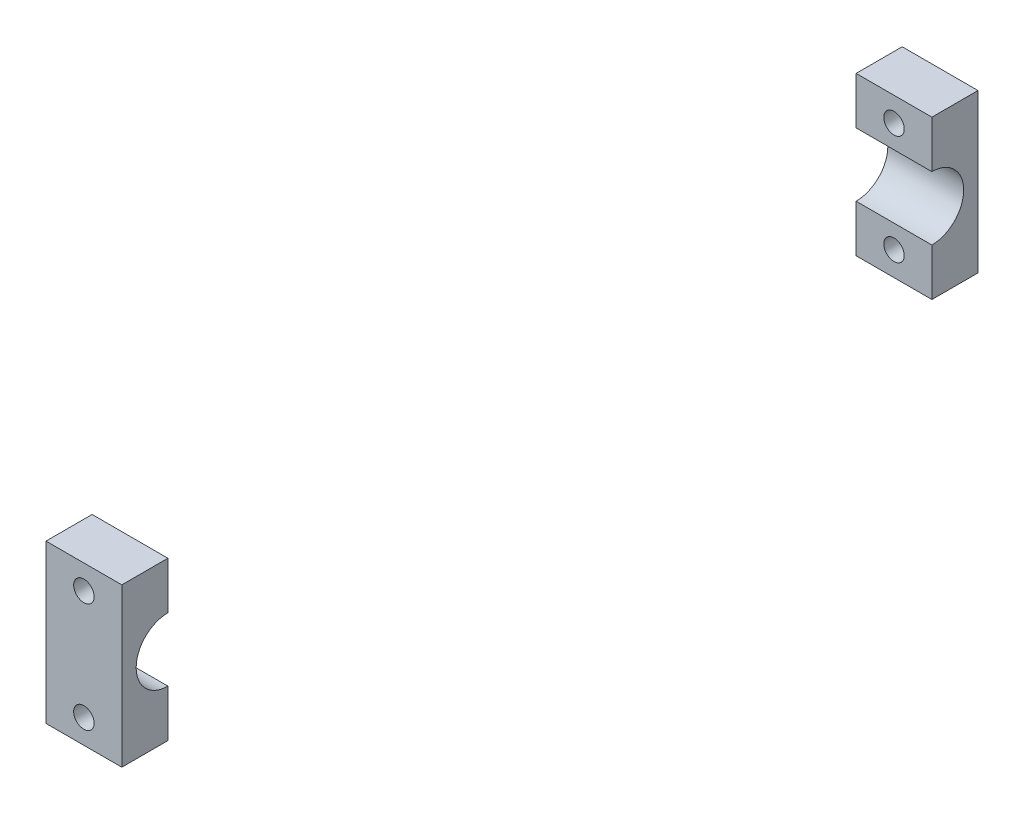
ISO-10303-21;
HEADER;
FILE_DESCRIPTION(('STEP AP214'),'2;1');
FILE_NAME('part.step','',(''),(''),'','','');
FILE_SCHEMA(('AUTOMOTIVE_DESIGN { 1 0 10303 214 1 1 1 1 }'));
ENDSEC;
DATA;
#1=APPLICATION_CONTEXT('core data for automotive mechanical design processes');
#2=APPLICATION_PROTOCOL_DEFINITION('international standard','automotive_design',2000,#1);
#3=PRODUCT_CONTEXT('',#1,'mechanical');
#4=PRODUCT('Part','Part','',(#3));
#5=PRODUCT_RELATED_PRODUCT_CATEGORY('part','',(#4));
#6=PRODUCT_DEFINITION_FORMATION('','',#4);
#7=PRODUCT_DEFINITION_CONTEXT('part definition',#1,'design');
#8=PRODUCT_DEFINITION('design','',#6,#7);
#9=PRODUCT_DEFINITION_SHAPE('','',#8);
#10=(LENGTH_UNIT() NAMED_UNIT(*) SI_UNIT(.MILLI.,.METRE.));
#11=(NAMED_UNIT(*) PLANE_ANGLE_UNIT() SI_UNIT($,.RADIAN.));
#12=(NAMED_UNIT(*) SI_UNIT($,.STERADIAN.) SOLID_ANGLE_UNIT());
#13=UNCERTAINTY_MEASURE_WITH_UNIT(LENGTH_MEASURE(1.E-05),#10,'distance_accuracy_value','');
#14=(GEOMETRIC_REPRESENTATION_CONTEXT(3) GLOBAL_UNCERTAINTY_ASSIGNED_CONTEXT((#13)) GLOBAL_UNIT_ASSIGNED_CONTEXT((#10,
#11,#12)) REPRESENTATION_CONTEXT('',''));
#15=CARTESIAN_POINT('',(0.,0.,0.));
#16=DIRECTION('',(0.,0.,1.));
#17=DIRECTION('',(1.,0.,0.));
#18=AXIS2_PLACEMENT_3D('',#15,#16,#17);
#19=CARTESIAN_POINT('',(14.8,0.,0.));
#20=DIRECTION('',(-1.,0.,0.));
#21=DIRECTION('',(0.,0.,1.));
#22=AXIS2_PLACEMENT_3D('',#19,#20,#21);
#23=PLANE('',#22);
#24=DIRECTION('',(0.,1.,0.));
#25=VECTOR('',#24,1.);
#26=CARTESIAN_POINT('',(14.8,-4.5,-83.579));
#27=LINE('',#26,#25);
#28=CARTESIAN_POINT('',(14.8,-54.92,-83.579));
#29=VERTEX_POINT('',#28);
#30=CARTESIAN_POINT('',(14.8,-24.08,-83.579));
#31=VERTEX_POINT('',#30);
#32=EDGE_CURVE('E144',#29,#31,#27,.T.);
#33=ORIENTED_EDGE('',*,*,#32,.T.);
#34=DIRECTION('',(0.,0.,1.));
#35=VECTOR('',#34,1.);
#36=CARTESIAN_POINT('',(14.8,-24.08,74.579));
#37=LINE('',#36,#35);
#38=CARTESIAN_POINT('',(14.8,-24.08,-74.579));
#39=VERTEX_POINT('',#38);
#40=EDGE_CURVE('E62',#31,#39,#37,.T.);
#41=ORIENTED_EDGE('',*,*,#40,.T.);
#42=DIRECTION('',(0.,-1.,0.));
#43=VECTOR('',#42,1.);
#44=CARTESIAN_POINT('',(14.8,-33.3,-74.579));
#45=LINE('',#44,#43);
#46=CARTESIAN_POINT('',(14.8,-33.3,-74.579));
#47=VERTEX_POINT('',#46);
#48=EDGE_CURVE('E124',#39,#47,#45,.T.);
#49=ORIENTED_EDGE('',*,*,#48,.T.);
#50=CARTESIAN_POINT('',(14.8,-39.5,-74.579));
#51=DIRECTION('',(-1.,0.,0.));
#52=DIRECTION('',(0.,0.,-1.));
#53=AXIS2_PLACEMENT_3D('',#50,#51,#52);
#54=CIRCLE('',#53,6.2);
#55=CARTESIAN_POINT('',(14.8,-45.7,-74.579));
#56=VERTEX_POINT('',#55);
#57=EDGE_CURVE('E147',#47,#56,#54,.T.);
#58=ORIENTED_EDGE('',*,*,#57,.T.);
#59=DIRECTION('',(0.,-1.,0.));
#60=VECTOR('',#59,1.);
#61=CARTESIAN_POINT('',(14.8,-54.92,-74.579));
#62=LINE('',#61,#60);
#63=CARTESIAN_POINT('',(14.8,-54.92,-74.579));
#64=VERTEX_POINT('',#63);
#65=EDGE_CURVE('E120',#56,#64,#62,.T.);
#66=ORIENTED_EDGE('',*,*,#65,.T.);
#67=DIRECTION('',(0.,0.,-1.));
#68=VECTOR('',#67,1.);
#69=CARTESIAN_POINT('',(14.8,-54.92,-83.579));
#70=LINE('',#69,#68);
#71=EDGE_CURVE('E114',#64,#29,#70,.T.);
#72=ORIENTED_EDGE('',*,*,#71,.T.);
#73=EDGE_LOOP('',(#33,#41,#49,#58,#66,#72));
#74=FACE_BOUND('',#73,.T.);
#75=ADVANCED_FACE('F46',(#74),#23,.F.);
#76=CARTESIAN_POINT('',(0.,0.,0.));
#77=DIRECTION('',(-1.,0.,0.));
#78=DIRECTION('',(0.,0.,1.));
#79=AXIS2_PLACEMENT_3D('',#76,#77,#78);
#80=PLANE('',#79);
#81=DIRECTION('',(0.,0.,1.));
#82=VECTOR('',#81,1.);
#83=CARTESIAN_POINT('',(0.,-24.08,74.579));
#84=LINE('',#83,#82);
#85=CARTESIAN_POINT('',(0.,-24.08,-83.5789999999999));
#86=VERTEX_POINT('',#85);
#87=CARTESIAN_POINT('',(0.,-24.08,-74.579));
#88=VERTEX_POINT('',#87);
#89=EDGE_CURVE('E50',#86,#88,#84,.T.);
#90=ORIENTED_EDGE('',*,*,#89,.F.);
#91=DIRECTION('',(0.,1.,0.));
#92=VECTOR('',#91,1.);
#93=CARTESIAN_POINT('',(0.,-39.5,-83.579));
#94=LINE('',#93,#92);
#95=CARTESIAN_POINT('',(0.,-54.92,-83.579));
#96=VERTEX_POINT('',#95);
#97=EDGE_CURVE('E105',#96,#86,#94,.T.);
#98=ORIENTED_EDGE('',*,*,#97,.F.);
#99=DIRECTION('',(0.,0.,-1.));
#100=VECTOR('',#99,1.);
#101=CARTESIAN_POINT('',(0.,-54.92,-83.579));
#102=LINE('',#101,#100);
#103=CARTESIAN_POINT('',(0.,-54.92,-74.579));
#104=VERTEX_POINT('',#103);
#105=EDGE_CURVE('E126',#104,#96,#102,.T.);
#106=ORIENTED_EDGE('',*,*,#105,.F.);
#107=DIRECTION('',(0.,-1.,0.));
#108=VECTOR('',#107,1.);
#109=CARTESIAN_POINT('',(0.,-54.92,-74.579));
#110=LINE('',#109,#108);
#111=CARTESIAN_POINT('',(0.,-45.7,-74.579));
#112=VERTEX_POINT('',#111);
#113=EDGE_CURVE('E128',#112,#104,#110,.T.);
#114=ORIENTED_EDGE('',*,*,#113,.F.);
#115=CARTESIAN_POINT('',(0.,-39.5,-74.579));
#116=DIRECTION('',(-1.,0.,0.));
#117=DIRECTION('',(0.,0.,-1.));
#118=AXIS2_PLACEMENT_3D('',#115,#116,#117);
#119=CIRCLE('',#118,6.2);
#120=CARTESIAN_POINT('',(0.,-33.3,-74.579));
#121=VERTEX_POINT('',#120);
#122=EDGE_CURVE('E133',#121,#112,#119,.T.);
#123=ORIENTED_EDGE('',*,*,#122,.F.);
#124=DIRECTION('',(0.,-1.,0.));
#125=VECTOR('',#124,1.);
#126=CARTESIAN_POINT('',(0.,-33.3,-74.579));
#127=LINE('',#126,#125);
#128=EDGE_CURVE('E108',#88,#121,#127,.T.);
#129=ORIENTED_EDGE('',*,*,#128,.F.);
#130=EDGE_LOOP('',(#90,#98,#106,#114,#123,#129));
#131=FACE_BOUND('',#130,.T.);
#132=ADVANCED_FACE('F103',(#131),#80,.T.);
#133=CARTESIAN_POINT('',(0.,-4.5,-83.579));
#134=DIRECTION('',(0.,0.,-1.));
#135=DIRECTION('',(0.,1.,0.));
#136=AXIS2_PLACEMENT_3D('',#133,#134,#135);
#137=PLANE('',#136);
#138=DIRECTION('',(-1.,0.,0.));
#139=VECTOR('',#138,1.);
#140=CARTESIAN_POINT('',(0.,-24.08,-83.579));
#141=LINE('',#140,#139);
#142=EDGE_CURVE('E94',#31,#86,#141,.T.);
#143=ORIENTED_EDGE('',*,*,#142,.F.);
#144=ORIENTED_EDGE('',*,*,#32,.F.);
#145=DIRECTION('',(1.,0.,0.));
#146=VECTOR('',#145,1.);
#147=CARTESIAN_POINT('',(0.,-54.92,-83.579));
#148=LINE('',#147,#146);
#149=EDGE_CURVE('E112',#96,#29,#148,.T.);
#150=ORIENTED_EDGE('',*,*,#149,.F.);
#151=ORIENTED_EDGE('',*,*,#97,.T.);
#152=EDGE_LOOP('',(#143,#144,#150,#151));
#153=FACE_BOUND('',#152,.T.);
#154=CARTESIAN_POINT('',(7.4,-28.8,-83.579));
#155=DIRECTION('',(0.,0.,-1.));
#156=DIRECTION('',(0.,1.,0.));
#157=AXIS2_PLACEMENT_3D('',#154,#155,#156);
#158=CIRCLE('',#157,2.);
#159=CARTESIAN_POINT('',(7.4,-26.8,-83.579));
#160=VERTEX_POINT('',#159);
#161=EDGE_CURVE('E113',#160,#160,#158,.F.);
#162=ORIENTED_EDGE('',*,*,#161,.T.);
#163=EDGE_LOOP('',(#162));
#164=FACE_BOUND('',#163,.T.);
#165=CARTESIAN_POINT('',(7.4,-50.2,-83.579));
#166=DIRECTION('',(0.,0.,-1.));
#167=DIRECTION('',(0.,1.,0.));
#168=AXIS2_PLACEMENT_3D('',#165,#166,#167);
#169=CIRCLE('',#168,2.);
#170=CARTESIAN_POINT('',(7.4,-48.2,-83.579));
#171=VERTEX_POINT('',#170);
#172=EDGE_CURVE('E117',#171,#171,#169,.F.);
#173=ORIENTED_EDGE('',*,*,#172,.T.);
#174=EDGE_LOOP('',(#173));
#175=FACE_BOUND('',#174,.T.);
#176=ADVANCED_FACE('F109',(#153,#164,#175),#137,.T.);
#177=CARTESIAN_POINT('',(0.,-54.92,-83.579));
#178=DIRECTION('',(0.,-1.,0.));
#179=DIRECTION('',(0.,0.,-1.));
#180=AXIS2_PLACEMENT_3D('',#177,#178,#179);
#181=PLANE('',#180);
#182=ORIENTED_EDGE('',*,*,#71,.F.);
#183=DIRECTION('',(1.,0.,0.));
#184=VECTOR('',#183,1.);
#185=CARTESIAN_POINT('',(0.,-54.92,-74.579));
#186=LINE('',#185,#184);
#187=EDGE_CURVE('E131',#104,#64,#186,.T.);
#188=ORIENTED_EDGE('',*,*,#187,.F.);
#189=ORIENTED_EDGE('',*,*,#105,.T.);
#190=ORIENTED_EDGE('',*,*,#149,.T.);
#191=EDGE_LOOP('',(#182,#188,#189,#190));
#192=FACE_BOUND('',#191,.T.);
#193=ADVANCED_FACE('F166',(#192),#181,.T.);
#194=CARTESIAN_POINT('',(0.,-54.92,-74.579));
#195=DIRECTION('',(0.,0.,1.));
#196=DIRECTION('',(1.,0.,0.));
#197=AXIS2_PLACEMENT_3D('',#194,#195,#196);
#198=PLANE('',#197);
#199=CARTESIAN_POINT('',(7.4,-50.2,-74.579));
#200=DIRECTION('',(0.,0.,1.));
#201=DIRECTION('',(1.,0.,0.));
#202=AXIS2_PLACEMENT_3D('',#199,#200,#201);
#203=CIRCLE('',#202,2.);
#204=CARTESIAN_POINT('',(9.4,-50.2,-74.579));
#205=VERTEX_POINT('',#204);
#206=EDGE_CURVE('E132',#205,#205,#203,.F.);
#207=ORIENTED_EDGE('',*,*,#206,.T.);
#208=EDGE_LOOP('',(#207));
#209=FACE_BOUND('',#208,.T.);
#210=ORIENTED_EDGE('',*,*,#65,.F.);
#211=DIRECTION('',(1.,0.,0.));
#212=VECTOR('',#211,1.);
#213=CARTESIAN_POINT('',(0.,-45.7,-74.579));
#214=LINE('',#213,#212);
#215=EDGE_CURVE('E136',#112,#56,#214,.T.);
#216=ORIENTED_EDGE('',*,*,#215,.F.);
#217=ORIENTED_EDGE('',*,*,#113,.T.);
#218=ORIENTED_EDGE('',*,*,#187,.T.);
#219=EDGE_LOOP('',(#210,#216,#217,#218));
#220=FACE_BOUND('',#219,.T.);
#221=ADVANCED_FACE('F163',(#209,#220),#198,.T.);
#222=CARTESIAN_POINT('',(0.,-39.5,-74.579));
#223=DIRECTION('',(1.,0.,0.));
#224=DIRECTION('',(0.,0.,-1.));
#225=AXIS2_PLACEMENT_3D('',#222,#223,#224);
#226=CYLINDRICAL_SURFACE('',#225,6.2);
#227=ORIENTED_EDGE('',*,*,#57,.F.);
#228=DIRECTION('',(1.,0.,0.));
#229=VECTOR('',#228,1.);
#230=CARTESIAN_POINT('',(0.,-33.3,-74.579));
#231=LINE('',#230,#229);
#232=EDGE_CURVE('E137',#121,#47,#231,.T.);
#233=ORIENTED_EDGE('',*,*,#232,.F.);
#234=ORIENTED_EDGE('',*,*,#122,.T.);
#235=ORIENTED_EDGE('',*,*,#215,.T.);
#236=EDGE_LOOP('',(#227,#233,#234,#235));
#237=FACE_BOUND('',#236,.T.);
#238=ADVANCED_FACE('F159',(#237),#226,.F.);
#239=CARTESIAN_POINT('',(0.,-33.3,-74.579));
#240=DIRECTION('',(0.,0.,1.));
#241=DIRECTION('',(1.,0.,0.));
#242=AXIS2_PLACEMENT_3D('',#239,#240,#241);
#243=PLANE('',#242);
#244=DIRECTION('',(1.,0.,0.));
#245=VECTOR('',#244,1.);
#246=CARTESIAN_POINT('',(0.,-24.08,-74.579));
#247=LINE('',#246,#245);
#248=EDGE_CURVE('E12',#88,#39,#247,.T.);
#249=ORIENTED_EDGE('',*,*,#248,.F.);
#250=ORIENTED_EDGE('',*,*,#128,.T.);
#251=ORIENTED_EDGE('',*,*,#232,.T.);
#252=ORIENTED_EDGE('',*,*,#48,.F.);
#253=EDGE_LOOP('',(#249,#250,#251,#252));
#254=FACE_BOUND('',#253,.T.);
#255=CARTESIAN_POINT('',(7.4,-28.8,-74.579));
#256=DIRECTION('',(0.,0.,1.));
#257=DIRECTION('',(1.,0.,0.));
#258=AXIS2_PLACEMENT_3D('',#255,#256,#257);
#259=CIRCLE('',#258,2.);
#260=CARTESIAN_POINT('',(9.4,-28.8,-74.579));
#261=VERTEX_POINT('',#260);
#262=EDGE_CURVE('E98',#261,#261,#259,.F.);
#263=ORIENTED_EDGE('',*,*,#262,.T.);
#264=EDGE_LOOP('',(#263));
#265=FACE_BOUND('',#264,.T.);
#266=ADVANCED_FACE('F186',(#254,#265),#243,.T.);
#267=CARTESIAN_POINT('',(7.4,-28.8,-90.));
#268=DIRECTION('',(0.,0.,1.));
#269=DIRECTION('',(1.,0.,0.));
#270=AXIS2_PLACEMENT_3D('',#267,#268,#269);
#271=CYLINDRICAL_SURFACE('',#270,2.);
#272=ORIENTED_EDGE('',*,*,#161,.F.);
#273=EDGE_LOOP('',(#272));
#274=FACE_BOUND('',#273,.T.);
#275=ORIENTED_EDGE('',*,*,#262,.F.);
#276=EDGE_LOOP('',(#275));
#277=FACE_BOUND('',#276,.T.);
#278=ADVANCED_FACE('F182',(#274,#277),#271,.F.);
#279=CARTESIAN_POINT('',(7.4,-50.2,-90.));
#280=DIRECTION('',(0.,0.,1.));
#281=DIRECTION('',(1.,0.,0.));
#282=AXIS2_PLACEMENT_3D('',#279,#280,#281);
#283=CYLINDRICAL_SURFACE('',#282,2.);
#284=ORIENTED_EDGE('',*,*,#172,.F.);
#285=EDGE_LOOP('',(#284));
#286=FACE_BOUND('',#285,.T.);
#287=ORIENTED_EDGE('',*,*,#206,.F.);
#288=EDGE_LOOP('',(#287));
#289=FACE_BOUND('',#288,.T.);
#290=ADVANCED_FACE('F185',(#286,#289),#283,.F.);
#291=CARTESIAN_POINT('',(14.8,-24.08,74.579));
#292=DIRECTION('',(0.,-1.,0.));
#293=DIRECTION('',(0.,0.,-1.));
#294=AXIS2_PLACEMENT_3D('',#291,#292,#293);
#295=PLANE('',#294);
#296=ORIENTED_EDGE('',*,*,#142,.T.);
#297=ORIENTED_EDGE('',*,*,#89,.T.);
#298=ORIENTED_EDGE('',*,*,#248,.T.);
#299=ORIENTED_EDGE('',*,*,#40,.F.);
#300=EDGE_LOOP('',(#296,#297,#298,#299));
#301=FACE_BOUND('',#300,.T.);
#302=ADVANCED_FACE('F48',(#301),#295,.F.);
#303=CLOSED_SHELL('',(#75,#132,#176,#193,#221,#238,#266,#278,#290,#302));
#304=MANIFOLD_SOLID_BREP('B2',#303);
#305=CARTESIAN_POINT('',(0.,-54.92,74.579));
#306=DIRECTION('',(0.,0.,-1.));
#307=DIRECTION('',(-1.,0.,0.));
#308=AXIS2_PLACEMENT_3D('',#305,#306,#307);
#309=PLANE('',#308);
#310=CARTESIAN_POINT('',(7.4,-50.2,74.579));
#311=DIRECTION('',(0.,0.,-1.));
#312=DIRECTION('',(-1.,0.,0.));
#313=AXIS2_PLACEMENT_3D('',#310,#311,#312);
#314=CIRCLE('',#313,2.);
#315=CARTESIAN_POINT('',(5.4,-50.2,74.579));
#316=VERTEX_POINT('',#315);
#317=EDGE_CURVE('E384',#316,#316,#314,.F.);
#318=ORIENTED_EDGE('',*,*,#317,.T.);
#319=EDGE_LOOP('',(#318));
#320=FACE_BOUND('',#319,.T.);
#321=DIRECTION('',(0.,1.,0.));
#322=VECTOR('',#321,1.);
#323=CARTESIAN_POINT('',(14.8,-54.92,74.579));
#324=LINE('',#323,#322);
#325=CARTESIAN_POINT('',(14.8,-54.92,74.579));
#326=VERTEX_POINT('',#325);
#327=CARTESIAN_POINT('',(14.8,-45.7,74.579));
#328=VERTEX_POINT('',#327);
#329=EDGE_CURVE('E368',#326,#328,#324,.T.);
#330=ORIENTED_EDGE('',*,*,#329,.F.);
#331=DIRECTION('',(1.,0.,0.));
#332=VECTOR('',#331,1.);
#333=CARTESIAN_POINT('',(0.,-54.92,74.579));
#334=LINE('',#333,#332);
#335=CARTESIAN_POINT('',(0.,-54.92,74.579));
#336=VERTEX_POINT('',#335);
#337=EDGE_CURVE('E333',#336,#326,#334,.T.);
#338=ORIENTED_EDGE('',*,*,#337,.F.);
#339=DIRECTION('',(0.,1.,0.));
#340=VECTOR('',#339,1.);
#341=CARTESIAN_POINT('',(0.,-54.92,74.579));
#342=LINE('',#341,#340);
#343=CARTESIAN_POINT('',(0.,-45.7,74.579));
#344=VERTEX_POINT('',#343);
#345=EDGE_CURVE('E362',#336,#344,#342,.T.);
#346=ORIENTED_EDGE('',*,*,#345,.T.);
#347=DIRECTION('',(1.,0.,0.));
#348=VECTOR('',#347,1.);
#349=CARTESIAN_POINT('',(0.,-45.7,74.579));
#350=LINE('',#349,#348);
#351=EDGE_CURVE('E381',#344,#328,#350,.T.);
#352=ORIENTED_EDGE('',*,*,#351,.T.);
#353=EDGE_LOOP('',(#330,#338,#346,#352));
#354=FACE_BOUND('',#353,.T.);
#355=ADVANCED_FACE('F282',(#320,#354),#309,.T.);
#356=CARTESIAN_POINT('',(7.4,-50.2,-90.));
#357=DIRECTION('',(0.,0.,1.));
#358=DIRECTION('',(1.,0.,0.));
#359=AXIS2_PLACEMENT_3D('',#356,#357,#358);
#360=CYLINDRICAL_SURFACE('',#359,2.);
#361=CARTESIAN_POINT('',(7.4,-50.2,83.579));
#362=DIRECTION('',(0.,0.,1.));
#363=DIRECTION('',(1.,0.,0.));
#364=AXIS2_PLACEMENT_3D('',#361,#362,#363);
#365=CIRCLE('',#364,2.);
#366=CARTESIAN_POINT('',(9.4,-50.2,83.579));
#367=VERTEX_POINT('',#366);
#368=EDGE_CURVE('E386',#367,#367,#365,.F.);
#369=ORIENTED_EDGE('',*,*,#368,.F.);
#370=EDGE_LOOP('',(#369));
#371=FACE_BOUND('',#370,.T.);
#372=ORIENTED_EDGE('',*,*,#317,.F.);
#373=EDGE_LOOP('',(#372));
#374=FACE_BOUND('',#373,.T.);
#375=ADVANCED_FACE('F424',(#371,#374),#360,.F.);
#376=CARTESIAN_POINT('',(0.,-54.92,83.579));
#377=DIRECTION('',(0.,-1.,0.));
#378=DIRECTION('',(0.,0.,-1.));
#379=AXIS2_PLACEMENT_3D('',#376,#377,#378);
#380=PLANE('',#379);
#381=DIRECTION('',(0.,0.,-1.));
#382=VECTOR('',#381,1.);
#383=CARTESIAN_POINT('',(14.8,-54.92,83.579));
#384=LINE('',#383,#382);
#385=CARTESIAN_POINT('',(14.8,-54.92,83.579));
#386=VERTEX_POINT('',#385);
#387=EDGE_CURVE('E366',#386,#326,#384,.T.);
#388=ORIENTED_EDGE('',*,*,#387,.F.);
#389=DIRECTION('',(1.,0.,0.));
#390=VECTOR('',#389,1.);
#391=CARTESIAN_POINT('',(0.,-54.92,83.579));
#392=LINE('',#391,#390);
#393=CARTESIAN_POINT('',(0.,-54.92,83.579));
#394=VERTEX_POINT('',#393);
#395=EDGE_CURVE('E290',#394,#386,#392,.T.);
#396=ORIENTED_EDGE('',*,*,#395,.F.);
#397=DIRECTION('',(0.,0.,-1.));
#398=VECTOR('',#397,1.);
#399=CARTESIAN_POINT('',(0.,-54.92,83.579));
#400=LINE('',#399,#398);
#401=EDGE_CURVE('E378',#394,#336,#400,.T.);
#402=ORIENTED_EDGE('',*,*,#401,.T.);
#403=ORIENTED_EDGE('',*,*,#337,.T.);
#404=EDGE_LOOP('',(#388,#396,#402,#403));
#405=FACE_BOUND('',#404,.T.);
#406=ADVANCED_FACE('F403',(#405),#380,.T.);
#407=CARTESIAN_POINT('',(7.4,-28.8,-90.));
#408=DIRECTION('',(0.,0.,1.));
#409=DIRECTION('',(1.,0.,0.));
#410=AXIS2_PLACEMENT_3D('',#407,#408,#409);
#411=CYLINDRICAL_SURFACE('',#410,2.);
#412=CARTESIAN_POINT('',(7.4,-28.8,83.579));
#413=DIRECTION('',(0.,0.,1.));
#414=DIRECTION('',(1.,0.,0.));
#415=AXIS2_PLACEMENT_3D('',#412,#413,#414);
#416=CIRCLE('',#415,2.);
#417=CARTESIAN_POINT('',(9.4,-28.8,83.579));
#418=VERTEX_POINT('',#417);
#419=EDGE_CURVE('E369',#418,#418,#416,.F.);
#420=ORIENTED_EDGE('',*,*,#419,.F.);
#421=EDGE_LOOP('',(#420));
#422=FACE_BOUND('',#421,.T.);
#423=CARTESIAN_POINT('',(7.4,-28.8,74.579));
#424=DIRECTION('',(0.,0.,-1.));
#425=DIRECTION('',(-1.,0.,0.));
#426=AXIS2_PLACEMENT_3D('',#423,#424,#425);
#427=CIRCLE('',#426,2.);
#428=CARTESIAN_POINT('',(5.4,-28.8,74.579));
#429=VERTEX_POINT('',#428);
#430=EDGE_CURVE('E388',#429,#429,#427,.F.);
#431=ORIENTED_EDGE('',*,*,#430,.F.);
#432=EDGE_LOOP('',(#431));
#433=FACE_BOUND('',#432,.T.);
#434=ADVANCED_FACE('F411',(#422,#433),#411,.F.);
#435=CARTESIAN_POINT('',(0.,-39.5,74.579));
#436=DIRECTION('',(1.,0.,0.));
#437=DIRECTION('',(0.,0.,-1.));
#438=AXIS2_PLACEMENT_3D('',#435,#436,#437);
#439=CYLINDRICAL_SURFACE('',#438,6.2);
#440=CARTESIAN_POINT('',(14.8,-39.5,74.579));
#441=DIRECTION('',(-1.,0.,0.));
#442=DIRECTION('',(0.,0.,1.));
#443=AXIS2_PLACEMENT_3D('',#440,#441,#442);
#444=CIRCLE('',#443,6.2);
#445=CARTESIAN_POINT('',(14.8,-33.3,74.579));
#446=VERTEX_POINT('',#445);
#447=EDGE_CURVE('E372',#328,#446,#444,.T.);
#448=ORIENTED_EDGE('',*,*,#447,.F.);
#449=ORIENTED_EDGE('',*,*,#351,.F.);
#450=CARTESIAN_POINT('',(0.,-39.5,74.579));
#451=DIRECTION('',(-1.,0.,0.));
#452=DIRECTION('',(0.,0.,1.));
#453=AXIS2_PLACEMENT_3D('',#450,#451,#452);
#454=CIRCLE('',#453,6.2);
#455=CARTESIAN_POINT('',(0.,-33.3,74.579));
#456=VERTEX_POINT('',#455);
#457=EDGE_CURVE('E359',#344,#456,#454,.T.);
#458=ORIENTED_EDGE('',*,*,#457,.T.);
#459=DIRECTION('',(1.,0.,0.));
#460=VECTOR('',#459,1.);
#461=CARTESIAN_POINT('',(0.,-33.3,74.579));
#462=LINE('',#461,#460);
#463=EDGE_CURVE('E358',#456,#446,#462,.T.);
#464=ORIENTED_EDGE('',*,*,#463,.T.);
#465=EDGE_LOOP('',(#448,#449,#458,#464));
#466=FACE_BOUND('',#465,.T.);
#467=ADVANCED_FACE('F409',(#466),#439,.F.);
#468=CARTESIAN_POINT('',(0.,-39.5,83.579));
#469=DIRECTION('',(0.,0.,1.));
#470=DIRECTION('',(1.,0.,0.));
#471=AXIS2_PLACEMENT_3D('',#468,#469,#470);
#472=PLANE('',#471);
#473=DIRECTION('',(1.,0.,0.));
#474=VECTOR('',#473,1.);
#475=CARTESIAN_POINT('',(0.,-24.08,83.579));
#476=LINE('',#475,#474);
#477=CARTESIAN_POINT('',(0.,-24.08,83.579));
#478=VERTEX_POINT('',#477);
#479=CARTESIAN_POINT('',(14.8,-24.08,83.579));
#480=VERTEX_POINT('',#479);
#481=EDGE_CURVE('E387',#478,#480,#476,.T.);
#482=ORIENTED_EDGE('',*,*,#481,.F.);
#483=DIRECTION('',(0.,-1.,0.));
#484=VECTOR('',#483,1.);
#485=CARTESIAN_POINT('',(0.,-4.5,83.579));
#486=LINE('',#485,#484);
#487=EDGE_CURVE('E305',#478,#394,#486,.T.);
#488=ORIENTED_EDGE('',*,*,#487,.T.);
#489=ORIENTED_EDGE('',*,*,#395,.T.);
#490=DIRECTION('',(0.,-1.,0.));
#491=VECTOR('',#490,1.);
#492=CARTESIAN_POINT('',(14.8,-39.5,83.579));
#493=LINE('',#492,#491);
#494=EDGE_CURVE('E327',#480,#386,#493,.T.);
#495=ORIENTED_EDGE('',*,*,#494,.F.);
#496=EDGE_LOOP('',(#482,#488,#489,#495));
#497=FACE_BOUND('',#496,.T.);
#498=ORIENTED_EDGE('',*,*,#419,.T.);
#499=EDGE_LOOP('',(#498));
#500=FACE_BOUND('',#499,.T.);
#501=ORIENTED_EDGE('',*,*,#368,.T.);
#502=EDGE_LOOP('',(#501));
#503=FACE_BOUND('',#502,.T.);
#504=ADVANCED_FACE('F404',(#497,#500,#503),#472,.T.);
#505=CARTESIAN_POINT('',(0.,-33.3,74.579));
#506=DIRECTION('',(0.,0.,-1.));
#507=DIRECTION('',(-1.,0.,0.));
#508=AXIS2_PLACEMENT_3D('',#505,#506,#507);
#509=PLANE('',#508);
#510=DIRECTION('',(-1.,0.,0.));
#511=VECTOR('',#510,1.);
#512=CARTESIAN_POINT('',(0.,-24.08,74.579));
#513=LINE('',#512,#511);
#514=CARTESIAN_POINT('',(14.8,-24.08,74.579));
#515=VERTEX_POINT('',#514);
#516=CARTESIAN_POINT('',(0.,-24.08,74.579));
#517=VERTEX_POINT('',#516);
#518=EDGE_CURVE('E44',#515,#517,#513,.T.);
#519=ORIENTED_EDGE('',*,*,#518,.F.);
#520=DIRECTION('',(0.,1.,0.));
#521=VECTOR('',#520,1.);
#522=CARTESIAN_POINT('',(14.8,-33.3,74.579));
#523=LINE('',#522,#521);
#524=EDGE_CURVE('E375',#446,#515,#523,.T.);
#525=ORIENTED_EDGE('',*,*,#524,.F.);
#526=ORIENTED_EDGE('',*,*,#463,.F.);
#527=DIRECTION('',(0.,1.,0.));
#528=VECTOR('',#527,1.);
#529=CARTESIAN_POINT('',(0.,-33.3,74.579));
#530=LINE('',#529,#528);
#531=EDGE_CURVE('E352',#456,#517,#530,.T.);
#532=ORIENTED_EDGE('',*,*,#531,.T.);
#533=EDGE_LOOP('',(#519,#525,#526,#532));
#534=FACE_BOUND('',#533,.T.);
#535=ORIENTED_EDGE('',*,*,#430,.T.);
#536=EDGE_LOOP('',(#535));
#537=FACE_BOUND('',#536,.T.);
#538=ADVANCED_FACE('F356',(#534,#537),#509,.T.);
#539=CARTESIAN_POINT('',(0.,0.,0.));
#540=DIRECTION('',(-1.,0.,0.));
#541=DIRECTION('',(0.,0.,1.));
#542=AXIS2_PLACEMENT_3D('',#539,#540,#541);
#543=PLANE('',#542);
#544=DIRECTION('',(0.,0.,1.));
#545=VECTOR('',#544,1.);
#546=CARTESIAN_POINT('',(0.,-24.08,74.579));
#547=LINE('',#546,#545);
#548=EDGE_CURVE('E344',#517,#478,#547,.T.);
#549=ORIENTED_EDGE('',*,*,#548,.F.);
#550=ORIENTED_EDGE('',*,*,#531,.F.);
#551=ORIENTED_EDGE('',*,*,#457,.F.);
#552=ORIENTED_EDGE('',*,*,#345,.F.);
#553=ORIENTED_EDGE('',*,*,#401,.F.);
#554=ORIENTED_EDGE('',*,*,#487,.F.);
#555=EDGE_LOOP('',(#549,#550,#551,#552,#553,#554));
#556=FACE_BOUND('',#555,.T.);
#557=ADVANCED_FACE('F284',(#556),#543,.T.);
#558=CARTESIAN_POINT('',(14.8,0.,0.));
#559=DIRECTION('',(-1.,0.,0.));
#560=DIRECTION('',(0.,0.,1.));
#561=AXIS2_PLACEMENT_3D('',#558,#559,#560);
#562=PLANE('',#561);
#563=ORIENTED_EDGE('',*,*,#524,.T.);
#564=DIRECTION('',(0.,0.,1.));
#565=VECTOR('',#564,1.);
#566=CARTESIAN_POINT('',(14.8,-24.08,74.579));
#567=LINE('',#566,#565);
#568=EDGE_CURVE('E296',#515,#480,#567,.T.);
#569=ORIENTED_EDGE('',*,*,#568,.T.);
#570=ORIENTED_EDGE('',*,*,#494,.T.);
#571=ORIENTED_EDGE('',*,*,#387,.T.);
#572=ORIENTED_EDGE('',*,*,#329,.T.);
#573=ORIENTED_EDGE('',*,*,#447,.T.);
#574=EDGE_LOOP('',(#563,#569,#570,#571,#572,#573));
#575=FACE_BOUND('',#574,.T.);
#576=ADVANCED_FACE('F407',(#575),#562,.F.);
#577=CARTESIAN_POINT('',(14.8,-24.08,74.579));
#578=DIRECTION('',(0.,-1.,0.));
#579=DIRECTION('',(0.,0.,-1.));
#580=AXIS2_PLACEMENT_3D('',#577,#578,#579);
#581=PLANE('',#580);
#582=ORIENTED_EDGE('',*,*,#481,.T.);
#583=ORIENTED_EDGE('',*,*,#568,.F.);
#584=ORIENTED_EDGE('',*,*,#518,.T.);
#585=ORIENTED_EDGE('',*,*,#548,.T.);
#586=EDGE_LOOP('',(#582,#583,#584,#585));
#587=FACE_BOUND('',#586,.T.);
#588=ADVANCED_FACE('F343',(#587),#581,.F.);
#589=CLOSED_SHELL('',(#355,#375,#406,#434,#467,#504,#538,#557,#576,#588));
#590=MANIFOLD_SOLID_BREP('B6',#589);
#591=ADVANCED_BREP_SHAPE_REPRESENTATION('',(#18,#304,#590),#14);
#592=SHAPE_DEFINITION_REPRESENTATION(#9,#591);
ENDSEC;
END-ISO-10303-21;
